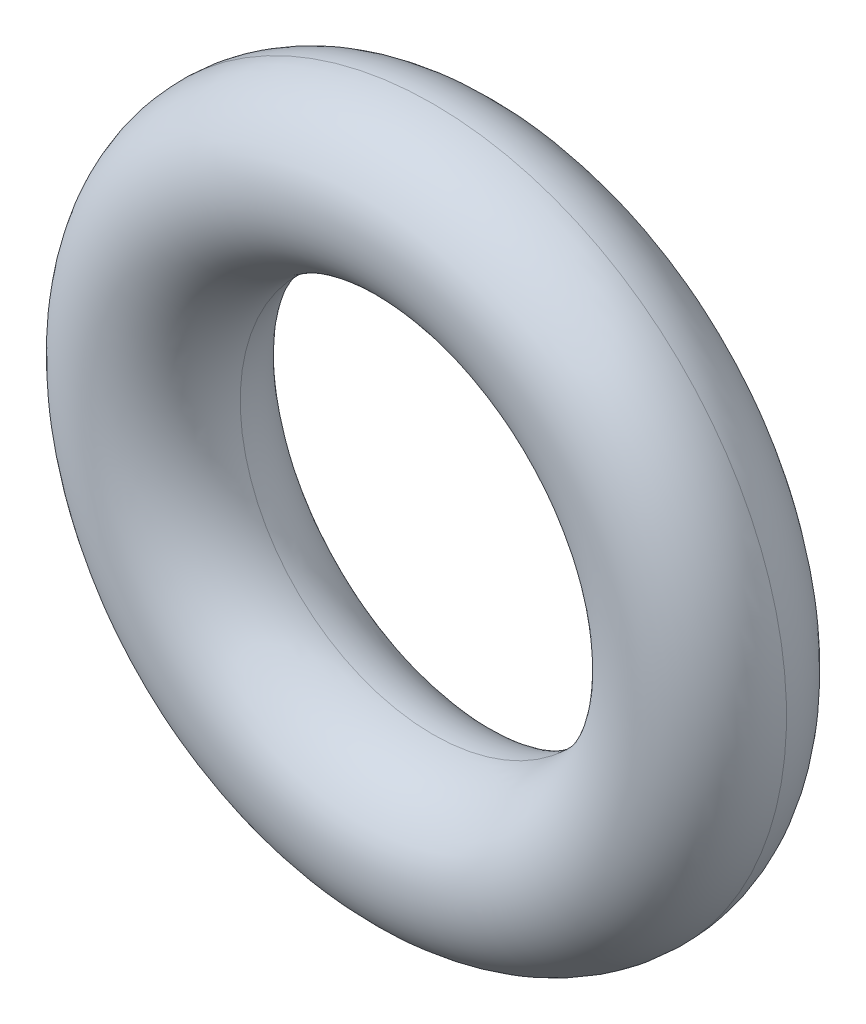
ISO-10303-21;
HEADER;
FILE_DESCRIPTION(('STEP AP214'),'2;1');
FILE_NAME('part.step','',(''),(''),'','','');
FILE_SCHEMA(('AUTOMOTIVE_DESIGN { 1 0 10303 214 1 1 1 1 }'));
ENDSEC;
DATA;
#1=APPLICATION_CONTEXT('core data for automotive mechanical design processes');
#2=APPLICATION_PROTOCOL_DEFINITION('international standard','automotive_design',2000,#1);
#3=PRODUCT_CONTEXT('',#1,'mechanical');
#4=PRODUCT('Part','Part','',(#3));
#5=PRODUCT_RELATED_PRODUCT_CATEGORY('part','',(#4));
#6=PRODUCT_DEFINITION_FORMATION('','',#4);
#7=PRODUCT_DEFINITION_CONTEXT('part definition',#1,'design');
#8=PRODUCT_DEFINITION('design','',#6,#7);
#9=PRODUCT_DEFINITION_SHAPE('','',#8);
#10=(LENGTH_UNIT() NAMED_UNIT(*) SI_UNIT(.MILLI.,.METRE.));
#11=(NAMED_UNIT(*) PLANE_ANGLE_UNIT() SI_UNIT($,.RADIAN.));
#12=(NAMED_UNIT(*) SI_UNIT($,.STERADIAN.) SOLID_ANGLE_UNIT());
#13=UNCERTAINTY_MEASURE_WITH_UNIT(LENGTH_MEASURE(1.E-05),#10,'distance_accuracy_value','');
#14=(GEOMETRIC_REPRESENTATION_CONTEXT(3) GLOBAL_UNCERTAINTY_ASSIGNED_CONTEXT((#13)) GLOBAL_UNIT_ASSIGNED_CONTEXT((#10,
#11,#12)) REPRESENTATION_CONTEXT('',''));
#15=CARTESIAN_POINT('',(0.,0.,0.));
#16=DIRECTION('',(0.,0.,1.));
#17=DIRECTION('',(1.,0.,0.));
#18=AXIS2_PLACEMENT_3D('',#15,#16,#17);
#19=CARTESIAN_POINT('',(0.,0.,1.27));
#20=DIRECTION('',(0.,0.,-1.));
#21=DIRECTION('',(0.,1.,0.));
#22=AXIS2_PLACEMENT_3D('',#19,#20,#21);
#23=TOROIDAL_SURFACE('',#22,4.318,1.27);
#24=CARTESIAN_POINT('',(0.,0.,1.27));
#25=DIRECTION('',(0.,0.,1.));
#26=DIRECTION('',(0.,-1.,0.));
#27=AXIS2_PLACEMENT_3D('',#24,#25,#26);
#28=CIRCLE('',#27,3.048);
#29=CARTESIAN_POINT('',(0.,-3.048,1.27));
#30=VERTEX_POINT('',#29);
#31=EDGE_CURVE('E18',#30,#30,#28,.F.);
#32=ORIENTED_EDGE('',*,*,#31,.T.);
#33=EDGE_LOOP('',(#32));
#34=FACE_BOUND('',#33,.T.);
#35=CARTESIAN_POINT('',(0.,0.,1.27));
#36=DIRECTION('',(0.,0.,-1.));
#37=DIRECTION('',(0.,1.,0.));
#38=AXIS2_PLACEMENT_3D('',#35,#36,#37);
#39=CIRCLE('',#38,5.588);
#40=CARTESIAN_POINT('',(0.,5.588,1.27));
#41=VERTEX_POINT('',#40);
#42=EDGE_CURVE('E8',#41,#41,#39,.F.);
#43=ORIENTED_EDGE('',*,*,#42,.T.);
#44=EDGE_LOOP('',(#43));
#45=FACE_BOUND('',#44,.T.);
#46=ADVANCED_FACE('F12',(#34,#45),#23,.T.);
#47=ORIENTED_EDGE('',*,*,#42,.F.);
#48=EDGE_LOOP('',(#47));
#49=FACE_BOUND('',#48,.T.);
#50=ORIENTED_EDGE('',*,*,#31,.F.);
#51=EDGE_LOOP('',(#50));
#52=FACE_BOUND('',#51,.T.);
#53=ADVANCED_FACE('F14',(#49,#52),#23,.T.);
#54=CLOSED_SHELL('',(#46,#53));
#55=MANIFOLD_SOLID_BREP('B1',#54);
#56=ADVANCED_BREP_SHAPE_REPRESENTATION('',(#18,#55),#14);
#57=SHAPE_DEFINITION_REPRESENTATION(#9,#56);
ENDSEC;
END-ISO-10303-21;
